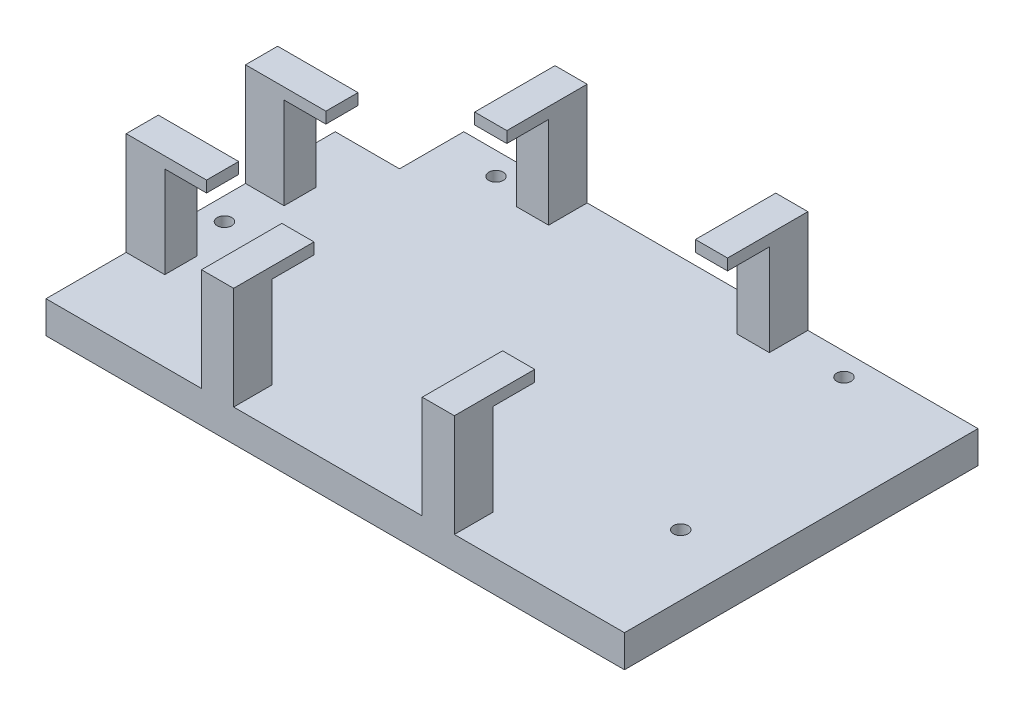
from build123d import *

# Parameters (mm, degrees)
SKETCH1_W           = 15
SKETCH1_H           = 15
BOSS_EXTRUDE1_DEPTH = 10
SKETCH2_R           = 2.25
SKETCH2_W           = 20
SKETCH2_H           = 20
CUT_EXTRUDE1_DEPTH  = 212.187120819
SKETCH3_W           = 12
SKETCH3_H           = 10
SKETCH3_W_2         = 10
SKETCH3_H_2         = 12
BOSS_EXTRUDE2_DEPTH = 28.5
SKETCH4_W           = 10
SKETCH4_H           = 3.5
BOSS_EXTRUDE3_DEPTH = 25
SKETCH5_W           = 10
SKETCH5_H           = 3.5
BOSS_EXTRUDE4_DEPTH = 25
SKETCH6_W           = 10
SKETCH6_H           = 3.5
BOSS_EXTRUDE5_DEPTH = 25


with BuildPart() as part:
    # Sketch1 → Boss-Extrude1 (new body)
    with BuildSketch(Plane(origin=(0, 0, 0), x_dir=(1, 0, 0), z_dir=(0, 1, 0))):
        with Locations((7.5, -7.5)):
            Rectangle(SKETCH1_W, SKETCH1_H)
        Polygon((15, 0), (180, 0), (180, -110), (0, -110), (0, -15), (15, -15), align=None)
    extrude(amount=-BOSS_EXTRUDE1_DEPTH)

    # Sketch2 → Cut-Extrude1 (cut, through all)
    with BuildSketch(Plane(origin=(0, 0, 0), x_dir=(1, 0, 0), z_dir=(0, 1, 0))):
        with Locations(Location((37.024611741, -7, 0), (0, 0, 270))):
            Circle(SKETCH2_R)
        with Locations(Location((145.292136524, -7, 0), (0, 0, 270))):
            Circle(SKETCH2_R)
        with Locations(Location((7, -61.474714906, 0), (0, 0, 270))):
            Circle(SKETCH2_R)
        with Locations(Location((161, -73.5, 0), (0, 0, 270))):
            Circle(SKETCH2_R)
        with Locations((10, -10)):
            Rectangle(SKETCH2_W, SKETCH2_H)
    extrude(amount=-CUT_EXTRUDE1_DEPTH, mode=Mode.SUBTRACT)

    # Sketch3 → Boss-Extrude2 (add)
    with BuildSketch(Plane(origin=(0, 0, 0), x_dir=(1, 0, 0), z_dir=(0, 1, 0))):
        with Locations((6, -42.916113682)):
            Rectangle(SKETCH3_W, SKETCH3_H)
        with Locations((6, -80.048213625)):
            Rectangle(SKETCH3_W, SKETCH3_H)
        with Locations((53.390652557, -6)):
            Rectangle(SKETCH3_W_2, SKETCH3_H_2)
        with Locations((122.070420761, -6)):
            Rectangle(SKETCH3_W_2, SKETCH3_H_2)
        with Locations((53.390652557, -104)):
            Rectangle(SKETCH3_W_2, SKETCH3_H_2)
        with Locations((122.070420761, -104)):
            Rectangle(SKETCH3_W_2, SKETCH3_H_2)
    extrude(amount=BOSS_EXTRUDE2_DEPTH)

    # Sketch4 → Boss-Extrude3 (add)
    with BuildSketch(Plane.ZY):
        with Locations((42.916113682, 30.25)):
            Rectangle(SKETCH4_W, SKETCH4_H)
        with Locations((80.048213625, 30.25)):
            Rectangle(SKETCH4_W, SKETCH4_H)
    extrude(amount=-BOSS_EXTRUDE3_DEPTH)

    # Sketch5 → Boss-Extrude4 (add)
    with BuildSketch(Plane.XY.offset(110)):
        with Locations((53.390652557, 30.25)):
            Rectangle(SKETCH5_W, SKETCH5_H)
        with Locations((122.070420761, 30.25)):
            Rectangle(SKETCH5_W, SKETCH5_H)
    extrude(amount=-BOSS_EXTRUDE4_DEPTH)

    # Sketch6 → Boss-Extrude5 (add)
    with BuildSketch(Plane(origin=(0, 0, 0), x_dir=(-1, 0, 0), z_dir=(0, 0, -1))):
        with Locations((-122.070420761, 30.25)):
            Rectangle(SKETCH6_W, SKETCH6_H)
        with Locations((-53.390652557, 30.25)):
            Rectangle(SKETCH6_W, SKETCH6_H)
    extrude(amount=-BOSS_EXTRUDE5_DEPTH)


solid = part.part
